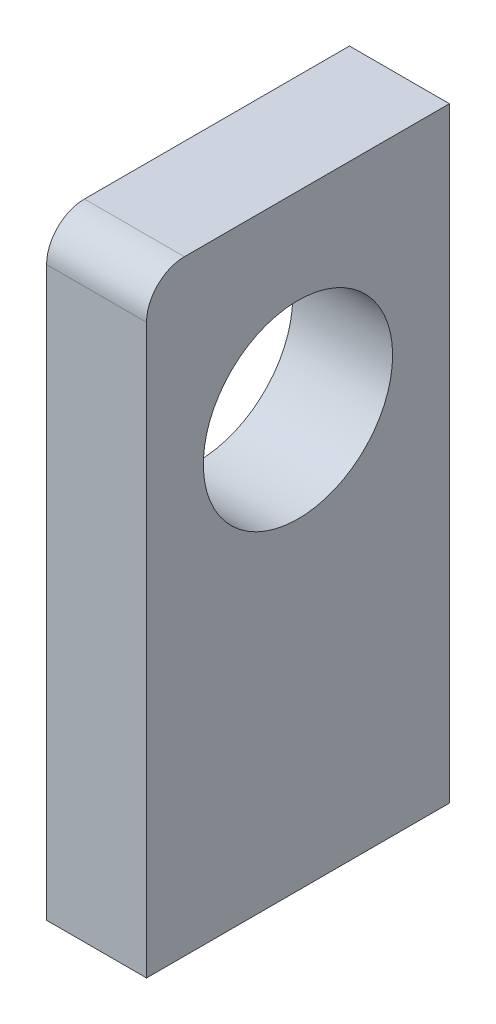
ISO-10303-21;
HEADER;
FILE_DESCRIPTION(('STEP AP214'),'2;1');
FILE_NAME('part.step','',(''),(''),'','','');
FILE_SCHEMA(('AUTOMOTIVE_DESIGN { 1 0 10303 214 1 1 1 1 }'));
ENDSEC;
DATA;
#1=APPLICATION_CONTEXT('core data for automotive mechanical design processes');
#2=APPLICATION_PROTOCOL_DEFINITION('international standard','automotive_design',2000,#1);
#3=PRODUCT_CONTEXT('',#1,'mechanical');
#4=PRODUCT('Part','Part','',(#3));
#5=PRODUCT_RELATED_PRODUCT_CATEGORY('part','',(#4));
#6=PRODUCT_DEFINITION_FORMATION('','',#4);
#7=PRODUCT_DEFINITION_CONTEXT('part definition',#1,'design');
#8=PRODUCT_DEFINITION('design','',#6,#7);
#9=PRODUCT_DEFINITION_SHAPE('','',#8);
#10=(LENGTH_UNIT() NAMED_UNIT(*) SI_UNIT(.MILLI.,.METRE.));
#11=(NAMED_UNIT(*) PLANE_ANGLE_UNIT() SI_UNIT($,.RADIAN.));
#12=(NAMED_UNIT(*) SI_UNIT($,.STERADIAN.) SOLID_ANGLE_UNIT());
#13=UNCERTAINTY_MEASURE_WITH_UNIT(LENGTH_MEASURE(1.E-05),#10,'distance_accuracy_value','');
#14=(GEOMETRIC_REPRESENTATION_CONTEXT(3) GLOBAL_UNCERTAINTY_ASSIGNED_CONTEXT((#13)) GLOBAL_UNIT_ASSIGNED_CONTEXT((#10,
#11,#12)) REPRESENTATION_CONTEXT('',''));
#15=CARTESIAN_POINT('',(0.,0.,0.));
#16=DIRECTION('',(0.,0.,1.));
#17=DIRECTION('',(1.,0.,0.));
#18=AXIS2_PLACEMENT_3D('',#15,#16,#17);
#19=CARTESIAN_POINT('',(13.2,0.,0.));
#20=DIRECTION('',(1.,0.,0.));
#21=DIRECTION('',(0.,0.,-1.));
#22=AXIS2_PLACEMENT_3D('',#19,#20,#21);
#23=PLANE('',#22);
#24=DIRECTION('',(0.,0.,1.));
#25=VECTOR('',#24,1.);
#26=CARTESIAN_POINT('',(13.2,0.,0.));
#27=LINE('',#26,#25);
#28=CARTESIAN_POINT('',(13.2,0.,-40.));
#29=VERTEX_POINT('',#28);
#30=CARTESIAN_POINT('',(13.2,0.,-5.));
#31=VERTEX_POINT('',#30);
#32=EDGE_CURVE('E127',#29,#31,#27,.T.);
#33=ORIENTED_EDGE('',*,*,#32,.T.);
#34=CARTESIAN_POINT('',(13.2,-5.,-5.));
#35=DIRECTION('',(1.,0.,0.));
#36=DIRECTION('',(0.,0.,-1.));
#37=AXIS2_PLACEMENT_3D('',#34,#35,#36);
#38=CIRCLE('',#37,5.);
#39=CARTESIAN_POINT('',(13.2,-5.,0.));
#40=VERTEX_POINT('',#39);
#41=EDGE_CURVE('E11',#31,#40,#38,.T.);
#42=ORIENTED_EDGE('',*,*,#41,.T.);
#43=DIRECTION('',(0.,-1.,0.));
#44=VECTOR('',#43,1.);
#45=CARTESIAN_POINT('',(13.2,0.,0.));
#46=LINE('',#45,#44);
#47=CARTESIAN_POINT('',(13.2,-80.,0.));
#48=VERTEX_POINT('',#47);
#49=EDGE_CURVE('E86',#40,#48,#46,.T.);
#50=ORIENTED_EDGE('',*,*,#49,.T.);
#51=DIRECTION('',(0.,0.,-1.));
#52=VECTOR('',#51,1.);
#53=CARTESIAN_POINT('',(13.2,-80.,0.));
#54=LINE('',#53,#52);
#55=CARTESIAN_POINT('',(13.2,-80.,-40.));
#56=VERTEX_POINT('',#55);
#57=EDGE_CURVE('E89',#48,#56,#54,.T.);
#58=ORIENTED_EDGE('',*,*,#57,.T.);
#59=DIRECTION('',(0.,1.,0.));
#60=VECTOR('',#59,1.);
#61=CARTESIAN_POINT('',(13.2,0.,-40.));
#62=LINE('',#61,#60);
#63=EDGE_CURVE('E107',#56,#29,#62,.T.);
#64=ORIENTED_EDGE('',*,*,#63,.T.);
#65=EDGE_LOOP('',(#33,#42,#50,#58,#64));
#66=FACE_BOUND('',#65,.T.);
#67=CARTESIAN_POINT('',(13.2,-25.,-20.));
#68=DIRECTION('',(1.,0.,0.));
#69=DIRECTION('',(0.,0.,-1.));
#70=AXIS2_PLACEMENT_3D('',#67,#68,#69);
#71=CIRCLE('',#70,12.5);
#72=CARTESIAN_POINT('',(13.2,-25.,-32.5));
#73=VERTEX_POINT('',#72);
#74=EDGE_CURVE('E138',#73,#73,#71,.T.);
#75=ORIENTED_EDGE('',*,*,#74,.F.);
#76=EDGE_LOOP('',(#75));
#77=FACE_BOUND('',#76,.T.);
#78=ADVANCED_FACE('F39',(#66,#77),#23,.T.);
#79=CARTESIAN_POINT('',(0.,0.,0.));
#80=DIRECTION('',(1.,0.,0.));
#81=DIRECTION('',(0.,0.,-1.));
#82=AXIS2_PLACEMENT_3D('',#79,#80,#81);
#83=PLANE('',#82);
#84=DIRECTION('',(0.,-1.,0.));
#85=VECTOR('',#84,1.);
#86=CARTESIAN_POINT('',(0.,0.,0.));
#87=LINE('',#86,#85);
#88=CARTESIAN_POINT('',(0.,-5.,0.));
#89=VERTEX_POINT('',#88);
#90=CARTESIAN_POINT('',(0.,-80.,0.));
#91=VERTEX_POINT('',#90);
#92=EDGE_CURVE('E110',#89,#91,#87,.T.);
#93=ORIENTED_EDGE('',*,*,#92,.F.);
#94=CARTESIAN_POINT('',(0.,-5.,-5.));
#95=DIRECTION('',(1.,0.,0.));
#96=DIRECTION('',(0.,0.,-1.));
#97=AXIS2_PLACEMENT_3D('',#94,#95,#96);
#98=CIRCLE('',#97,5.);
#99=CARTESIAN_POINT('',(0.,0.,-5.));
#100=VERTEX_POINT('',#99);
#101=EDGE_CURVE('E62',#89,#100,#98,.F.);
#102=ORIENTED_EDGE('',*,*,#101,.T.);
#103=DIRECTION('',(0.,0.,1.));
#104=VECTOR('',#103,1.);
#105=CARTESIAN_POINT('',(0.,0.,0.));
#106=LINE('',#105,#104);
#107=CARTESIAN_POINT('',(0.,0.,-40.));
#108=VERTEX_POINT('',#107);
#109=EDGE_CURVE('E97',#108,#100,#106,.T.);
#110=ORIENTED_EDGE('',*,*,#109,.F.);
#111=DIRECTION('',(0.,1.,0.));
#112=VECTOR('',#111,1.);
#113=CARTESIAN_POINT('',(0.,0.,-40.));
#114=LINE('',#113,#112);
#115=CARTESIAN_POINT('',(0.,-80.,-40.));
#116=VERTEX_POINT('',#115);
#117=EDGE_CURVE('E130',#116,#108,#114,.T.);
#118=ORIENTED_EDGE('',*,*,#117,.F.);
#119=DIRECTION('',(0.,0.,-1.));
#120=VECTOR('',#119,1.);
#121=CARTESIAN_POINT('',(0.,-80.,0.));
#122=LINE('',#121,#120);
#123=EDGE_CURVE('E133',#91,#116,#122,.T.);
#124=ORIENTED_EDGE('',*,*,#123,.F.);
#125=EDGE_LOOP('',(#93,#102,#110,#118,#124));
#126=FACE_BOUND('',#125,.T.);
#127=CARTESIAN_POINT('',(0.,-25.,-20.));
#128=DIRECTION('',(1.,0.,0.));
#129=DIRECTION('',(0.,0.,-1.));
#130=AXIS2_PLACEMENT_3D('',#127,#128,#129);
#131=CIRCLE('',#130,12.5);
#132=CARTESIAN_POINT('',(0.,-25.,-32.5));
#133=VERTEX_POINT('',#132);
#134=EDGE_CURVE('E143',#133,#133,#131,.T.);
#135=ORIENTED_EDGE('',*,*,#134,.T.);
#136=EDGE_LOOP('',(#135));
#137=FACE_BOUND('',#136,.T.);
#138=ADVANCED_FACE('F154',(#126,#137),#83,.F.);
#139=CARTESIAN_POINT('',(13.2,0.,0.));
#140=DIRECTION('',(0.,0.,-1.));
#141=DIRECTION('',(0.,1.,0.));
#142=AXIS2_PLACEMENT_3D('',#139,#140,#141);
#143=PLANE('',#142);
#144=ORIENTED_EDGE('',*,*,#49,.F.);
#145=DIRECTION('',(-1.,0.,0.));
#146=VECTOR('',#145,1.);
#147=CARTESIAN_POINT('',(13.2,-5.,0.));
#148=LINE('',#147,#146);
#149=EDGE_CURVE('E113',#40,#89,#148,.T.);
#150=ORIENTED_EDGE('',*,*,#149,.T.);
#151=ORIENTED_EDGE('',*,*,#92,.T.);
#152=DIRECTION('',(-1.,0.,0.));
#153=VECTOR('',#152,1.);
#154=CARTESIAN_POINT('',(13.2,-80.,0.));
#155=LINE('',#154,#153);
#156=EDGE_CURVE('E102',#48,#91,#155,.T.);
#157=ORIENTED_EDGE('',*,*,#156,.F.);
#158=EDGE_LOOP('',(#144,#150,#151,#157));
#159=FACE_BOUND('',#158,.T.);
#160=ADVANCED_FACE('F109',(#159),#143,.F.);
#161=CARTESIAN_POINT('',(13.2,-80.,0.));
#162=DIRECTION('',(0.,1.,0.));
#163=DIRECTION('',(0.,0.,1.));
#164=AXIS2_PLACEMENT_3D('',#161,#162,#163);
#165=PLANE('',#164);
#166=ORIENTED_EDGE('',*,*,#123,.T.);
#167=DIRECTION('',(-1.,0.,0.));
#168=VECTOR('',#167,1.);
#169=CARTESIAN_POINT('',(13.2,-80.,-40.));
#170=LINE('',#169,#168);
#171=EDGE_CURVE('E104',#56,#116,#170,.T.);
#172=ORIENTED_EDGE('',*,*,#171,.F.);
#173=ORIENTED_EDGE('',*,*,#57,.F.);
#174=ORIENTED_EDGE('',*,*,#156,.T.);
#175=EDGE_LOOP('',(#166,#172,#173,#174));
#176=FACE_BOUND('',#175,.T.);
#177=ADVANCED_FACE('F101',(#176),#165,.F.);
#178=CARTESIAN_POINT('',(13.2,0.,-40.));
#179=DIRECTION('',(0.,0.,1.));
#180=DIRECTION('',(0.,-1.,0.));
#181=AXIS2_PLACEMENT_3D('',#178,#179,#180);
#182=PLANE('',#181);
#183=ORIENTED_EDGE('',*,*,#117,.T.);
#184=DIRECTION('',(-1.,0.,0.));
#185=VECTOR('',#184,1.);
#186=CARTESIAN_POINT('',(13.2,0.,-40.));
#187=LINE('',#186,#185);
#188=EDGE_CURVE('E118',#29,#108,#187,.T.);
#189=ORIENTED_EDGE('',*,*,#188,.F.);
#190=ORIENTED_EDGE('',*,*,#63,.F.);
#191=ORIENTED_EDGE('',*,*,#171,.T.);
#192=EDGE_LOOP('',(#183,#189,#190,#191));
#193=FACE_BOUND('',#192,.T.);
#194=ADVANCED_FACE('F165',(#193),#182,.F.);
#195=CARTESIAN_POINT('',(13.2,0.,0.));
#196=DIRECTION('',(0.,-1.,0.));
#197=DIRECTION('',(0.,0.,-1.));
#198=AXIS2_PLACEMENT_3D('',#195,#196,#197);
#199=PLANE('',#198);
#200=ORIENTED_EDGE('',*,*,#109,.T.);
#201=DIRECTION('',(-1.,0.,0.));
#202=VECTOR('',#201,1.);
#203=CARTESIAN_POINT('',(13.2,0.,-5.));
#204=LINE('',#203,#202);
#205=EDGE_CURVE('E48',#100,#31,#204,.F.);
#206=ORIENTED_EDGE('',*,*,#205,.T.);
#207=ORIENTED_EDGE('',*,*,#32,.F.);
#208=ORIENTED_EDGE('',*,*,#188,.T.);
#209=EDGE_LOOP('',(#200,#206,#207,#208));
#210=FACE_BOUND('',#209,.T.);
#211=ADVANCED_FACE('F162',(#210),#199,.F.);
#212=CARTESIAN_POINT('',(13.2,-25.,-20.));
#213=DIRECTION('',(-1.,0.,0.));
#214=DIRECTION('',(0.,0.,1.));
#215=AXIS2_PLACEMENT_3D('',#212,#213,#214);
#216=CYLINDRICAL_SURFACE('',#215,12.5);
#217=ORIENTED_EDGE('',*,*,#74,.T.);
#218=EDGE_LOOP('',(#217));
#219=FACE_BOUND('',#218,.T.);
#220=ORIENTED_EDGE('',*,*,#134,.F.);
#221=EDGE_LOOP('',(#220));
#222=FACE_BOUND('',#221,.T.);
#223=ADVANCED_FACE('F151',(#219,#222),#216,.F.);
#224=CARTESIAN_POINT('',(13.2,-5.,-5.));
#225=DIRECTION('',(-1.,0.,0.));
#226=DIRECTION('',(0.,0.,1.));
#227=AXIS2_PLACEMENT_3D('',#224,#225,#226);
#228=CYLINDRICAL_SURFACE('',#227,5.);
#229=ORIENTED_EDGE('',*,*,#41,.F.);
#230=ORIENTED_EDGE('',*,*,#205,.F.);
#231=ORIENTED_EDGE('',*,*,#101,.F.);
#232=ORIENTED_EDGE('',*,*,#149,.F.);
#233=EDGE_LOOP('',(#229,#230,#231,#232));
#234=FACE_BOUND('',#233,.T.);
#235=ADVANCED_FACE('F41',(#234),#228,.T.);
#236=CLOSED_SHELL('',(#78,#138,#160,#177,#194,#211,#223,#235));
#237=MANIFOLD_SOLID_BREP('B2',#236);
#238=ADVANCED_BREP_SHAPE_REPRESENTATION('',(#18,#237),#14);
#239=SHAPE_DEFINITION_REPRESENTATION(#9,#238);
ENDSEC;
END-ISO-10303-21;
